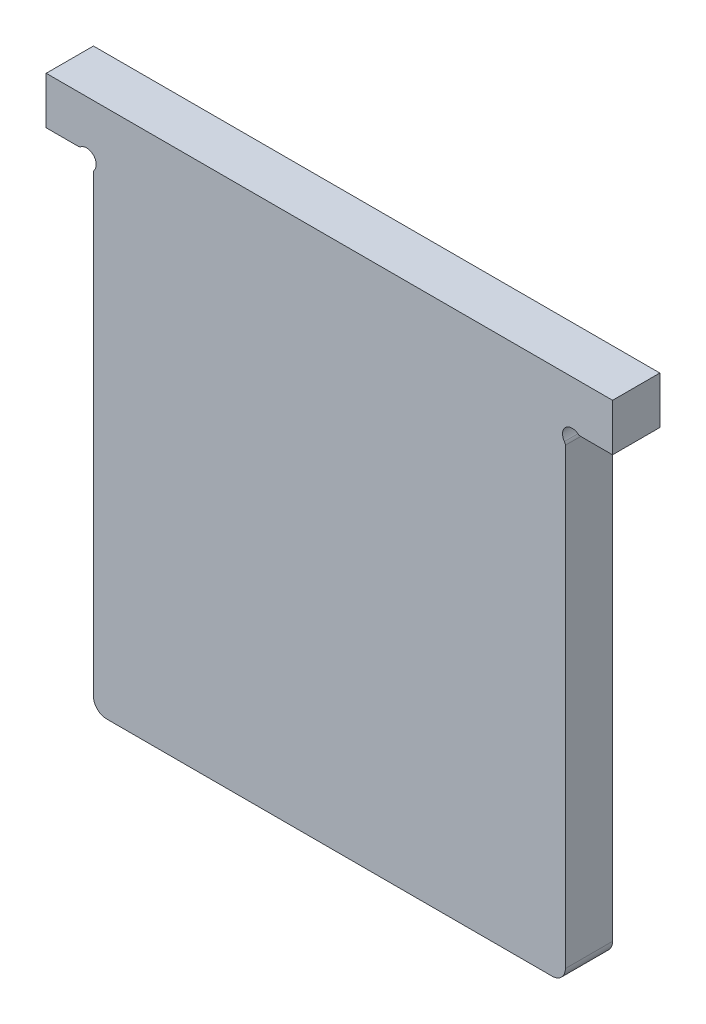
ISO-10303-21;
HEADER;
FILE_DESCRIPTION(('STEP AP214'),'2;1');
FILE_NAME('part.step','',(''),(''),'','','');
FILE_SCHEMA(('AUTOMOTIVE_DESIGN { 1 0 10303 214 1 1 1 1 }'));
ENDSEC;
DATA;
#1=APPLICATION_CONTEXT('core data for automotive mechanical design processes');
#2=APPLICATION_PROTOCOL_DEFINITION('international standard','automotive_design',2000,#1);
#3=PRODUCT_CONTEXT('',#1,'mechanical');
#4=PRODUCT('Part','Part','',(#3));
#5=PRODUCT_RELATED_PRODUCT_CATEGORY('part','',(#4));
#6=PRODUCT_DEFINITION_FORMATION('','',#4);
#7=PRODUCT_DEFINITION_CONTEXT('part definition',#1,'design');
#8=PRODUCT_DEFINITION('design','',#6,#7);
#9=PRODUCT_DEFINITION_SHAPE('','',#8);
#10=(LENGTH_UNIT() NAMED_UNIT(*) SI_UNIT(.MILLI.,.METRE.));
#11=(NAMED_UNIT(*) PLANE_ANGLE_UNIT() SI_UNIT($,.RADIAN.));
#12=(NAMED_UNIT(*) SI_UNIT($,.STERADIAN.) SOLID_ANGLE_UNIT());
#13=UNCERTAINTY_MEASURE_WITH_UNIT(LENGTH_MEASURE(1.E-05),#10,'distance_accuracy_value','');
#14=(GEOMETRIC_REPRESENTATION_CONTEXT(3) GLOBAL_UNCERTAINTY_ASSIGNED_CONTEXT((#13)) GLOBAL_UNIT_ASSIGNED_CONTEXT((#10,
#11,#12)) REPRESENTATION_CONTEXT('',''));
#15=CARTESIAN_POINT('',(0.,0.,0.));
#16=DIRECTION('',(0.,0.,1.));
#17=DIRECTION('',(1.,0.,0.));
#18=AXIS2_PLACEMENT_3D('',#15,#16,#17);
#19=CARTESIAN_POINT('',(149.9,280.,25.));
#20=DIRECTION('',(1.,0.,0.));
#21=DIRECTION('',(0.,0.,-1.));
#22=AXIS2_PLACEMENT_3D('',#19,#20,#21);
#23=PLANE('',#22);
#24=DIRECTION('',(0.,-1.,0.));
#25=VECTOR('',#24,1.);
#26=CARTESIAN_POINT('',(149.9,280.,0.));
#27=LINE('',#26,#25);
#28=CARTESIAN_POINT('',(149.9,280.,0.));
#29=VERTEX_POINT('',#28);
#30=CARTESIAN_POINT('',(149.9,255.,0.));
#31=VERTEX_POINT('',#30);
#32=EDGE_CURVE('E191',#29,#31,#27,.T.);
#33=ORIENTED_EDGE('',*,*,#32,.F.);
#34=DIRECTION('',(0.,0.,-1.));
#35=VECTOR('',#34,1.);
#36=CARTESIAN_POINT('',(149.9,280.,25.));
#37=LINE('',#36,#35);
#38=CARTESIAN_POINT('',(149.9,280.,25.));
#39=VERTEX_POINT('',#38);
#40=EDGE_CURVE('E234',#39,#29,#37,.T.);
#41=ORIENTED_EDGE('',*,*,#40,.F.);
#42=DIRECTION('',(0.,-1.,0.));
#43=VECTOR('',#42,1.);
#44=CARTESIAN_POINT('',(149.9,280.,25.));
#45=LINE('',#44,#43);
#46=CARTESIAN_POINT('',(149.9,255.,25.));
#47=VERTEX_POINT('',#46);
#48=EDGE_CURVE('E192',#39,#47,#45,.T.);
#49=ORIENTED_EDGE('',*,*,#48,.T.);
#50=DIRECTION('',(0.,0.,-1.));
#51=VECTOR('',#50,1.);
#52=CARTESIAN_POINT('',(149.9,255.,25.));
#53=LINE('',#52,#51);
#54=EDGE_CURVE('E213',#47,#31,#53,.T.);
#55=ORIENTED_EDGE('',*,*,#54,.T.);
#56=EDGE_LOOP('',(#33,#41,#49,#55));
#57=FACE_BOUND('',#56,.T.);
#58=ADVANCED_FACE('F33',(#57),#23,.T.);
#59=CARTESIAN_POINT('',(0.,280.,25.));
#60=DIRECTION('',(0.,1.,0.));
#61=DIRECTION('',(0.,0.,1.));
#62=AXIS2_PLACEMENT_3D('',#59,#60,#61);
#63=PLANE('',#62);
#64=DIRECTION('',(1.,0.,0.));
#65=VECTOR('',#64,1.);
#66=CARTESIAN_POINT('',(0.,280.,0.));
#67=LINE('',#66,#65);
#68=CARTESIAN_POINT('',(-149.9,280.,0.));
#69=VERTEX_POINT('',#68);
#70=EDGE_CURVE('E196',#69,#29,#67,.T.);
#71=ORIENTED_EDGE('',*,*,#70,.F.);
#72=DIRECTION('',(0.,0.,-1.));
#73=VECTOR('',#72,1.);
#74=CARTESIAN_POINT('',(-149.9,280.,25.));
#75=LINE('',#74,#73);
#76=CARTESIAN_POINT('',(-149.9,280.,25.));
#77=VERTEX_POINT('',#76);
#78=EDGE_CURVE('E183',#77,#69,#75,.T.);
#79=ORIENTED_EDGE('',*,*,#78,.F.);
#80=DIRECTION('',(1.,0.,0.));
#81=VECTOR('',#80,1.);
#82=CARTESIAN_POINT('',(0.,280.,25.));
#83=LINE('',#82,#81);
#84=EDGE_CURVE('E161',#77,#39,#83,.T.);
#85=ORIENTED_EDGE('',*,*,#84,.T.);
#86=ORIENTED_EDGE('',*,*,#40,.T.);
#87=EDGE_LOOP('',(#71,#79,#85,#86));
#88=FACE_BOUND('',#87,.T.);
#89=ADVANCED_FACE('F273',(#88),#63,.T.);
#90=CARTESIAN_POINT('',(0.,0.,25.));
#91=DIRECTION('',(0.,1.,0.));
#92=DIRECTION('',(0.,0.,1.));
#93=AXIS2_PLACEMENT_3D('',#90,#91,#92);
#94=PLANE('',#93);
#95=DIRECTION('',(1.,0.,0.));
#96=VECTOR('',#95,1.);
#97=CARTESIAN_POINT('',(0.,0.,0.));
#98=LINE('',#97,#96);
#99=CARTESIAN_POINT('',(-117.9,0.,0.));
#100=VERTEX_POINT('',#99);
#101=CARTESIAN_POINT('',(117.9,0.,0.));
#102=VERTEX_POINT('',#101);
#103=EDGE_CURVE('E230',#100,#102,#98,.T.);
#104=ORIENTED_EDGE('',*,*,#103,.T.);
#105=DIRECTION('',(0.,0.,-1.));
#106=VECTOR('',#105,1.);
#107=CARTESIAN_POINT('',(117.9,0.,25.));
#108=LINE('',#107,#106);
#109=CARTESIAN_POINT('',(117.9,0.,25.));
#110=VERTEX_POINT('',#109);
#111=EDGE_CURVE('E41',#102,#110,#108,.F.);
#112=ORIENTED_EDGE('',*,*,#111,.T.);
#113=DIRECTION('',(1.,0.,0.));
#114=VECTOR('',#113,1.);
#115=CARTESIAN_POINT('',(0.,0.,25.));
#116=LINE('',#115,#114);
#117=CARTESIAN_POINT('',(-117.9,0.,25.));
#118=VERTEX_POINT('',#117);
#119=EDGE_CURVE('E210',#118,#110,#116,.T.);
#120=ORIENTED_EDGE('',*,*,#119,.F.);
#121=DIRECTION('',(0.,0.,-1.));
#122=VECTOR('',#121,1.);
#123=CARTESIAN_POINT('',(-117.9,0.,25.));
#124=LINE('',#123,#122);
#125=EDGE_CURVE('E186',#100,#118,#124,.F.);
#126=ORIENTED_EDGE('',*,*,#125,.F.);
#127=EDGE_LOOP('',(#104,#112,#120,#126));
#128=FACE_BOUND('',#127,.T.);
#129=ADVANCED_FACE('F278',(#128),#94,.F.);
#130=CARTESIAN_POINT('',(124.9,246.868959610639,25.));
#131=DIRECTION('',(1.,0.,0.));
#132=DIRECTION('',(0.,1.,0.));
#133=AXIS2_PLACEMENT_3D('',#130,#131,#132);
#134=PLANE('',#133);
#135=DIRECTION('',(0.,-1.,0.));
#136=VECTOR('',#135,1.);
#137=CARTESIAN_POINT('',(124.9,246.868959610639,25.));
#138=LINE('',#137,#136);
#139=CARTESIAN_POINT('',(124.9,246.868959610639,25.));
#140=VERTEX_POINT('',#139);
#141=CARTESIAN_POINT('',(124.9,7.00000000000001,25.));
#142=VERTEX_POINT('',#141);
#143=EDGE_CURVE('E207',#140,#142,#138,.T.);
#144=ORIENTED_EDGE('',*,*,#143,.T.);
#145=DIRECTION('',(0.,0.,-1.));
#146=VECTOR('',#145,1.);
#147=CARTESIAN_POINT('',(124.9,7.00000000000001,0.));
#148=LINE('',#147,#146);
#149=CARTESIAN_POINT('',(124.9,7.00000000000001,0.));
#150=VERTEX_POINT('',#149);
#151=EDGE_CURVE('E236',#142,#150,#148,.T.);
#152=ORIENTED_EDGE('',*,*,#151,.T.);
#153=DIRECTION('',(0.,-1.,0.));
#154=VECTOR('',#153,1.);
#155=CARTESIAN_POINT('',(124.9,246.868959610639,0.));
#156=LINE('',#155,#154);
#157=CARTESIAN_POINT('',(124.9,246.868959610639,0.));
#158=VERTEX_POINT('',#157);
#159=EDGE_CURVE('E228',#158,#150,#156,.T.);
#160=ORIENTED_EDGE('',*,*,#159,.F.);
#161=DIRECTION('',(0.,0.,-1.));
#162=VECTOR('',#161,1.);
#163=CARTESIAN_POINT('',(124.9,246.868959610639,25.));
#164=LINE('',#163,#162);
#165=EDGE_CURVE('E237',#140,#158,#164,.T.);
#166=ORIENTED_EDGE('',*,*,#165,.F.);
#167=EDGE_LOOP('',(#144,#152,#160,#166));
#168=FACE_BOUND('',#167,.T.);
#169=ADVANCED_FACE('F251',(#168),#134,.T.);
#170=CARTESIAN_POINT('',(122.4,246.868959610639,25.));
#171=DIRECTION('',(0.,0.,-1.));
#172=DIRECTION('',(-1.,0.,0.));
#173=AXIS2_PLACEMENT_3D('',#170,#171,#172);
#174=CYLINDRICAL_SURFACE('',#173,2.5);
#175=CARTESIAN_POINT('',(122.4,246.868959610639,0.));
#176=DIRECTION('',(0.,0.,-1.));
#177=DIRECTION('',(-1.,0.,0.));
#178=AXIS2_PLACEMENT_3D('',#175,#176,#177);
#179=CIRCLE('',#178,2.5);
#180=CARTESIAN_POINT('',(124.408633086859,248.357379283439,0.));
#181=VERTEX_POINT('',#180);
#182=EDGE_CURVE('E225',#181,#158,#179,.T.);
#183=ORIENTED_EDGE('',*,*,#182,.F.);
#184=DIRECTION('',(0.,0.,-1.));
#185=VECTOR('',#184,1.);
#186=CARTESIAN_POINT('',(124.408633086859,248.357379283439,25.));
#187=LINE('',#186,#185);
#188=CARTESIAN_POINT('',(124.408633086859,248.357379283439,25.));
#189=VERTEX_POINT('',#188);
#190=EDGE_CURVE('E239',#189,#181,#187,.T.);
#191=ORIENTED_EDGE('',*,*,#190,.F.);
#192=CARTESIAN_POINT('',(122.4,246.868959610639,25.));
#193=DIRECTION('',(0.,0.,-1.));
#194=DIRECTION('',(-1.,0.,0.));
#195=AXIS2_PLACEMENT_3D('',#192,#193,#194);
#196=CIRCLE('',#195,2.5);
#197=EDGE_CURVE('E204',#189,#140,#196,.T.);
#198=ORIENTED_EDGE('',*,*,#197,.T.);
#199=ORIENTED_EDGE('',*,*,#165,.T.);
#200=EDGE_LOOP('',(#183,#191,#198,#199));
#201=FACE_BOUND('',#200,.T.);
#202=ADVANCED_FACE('F260',(#201),#174,.T.);
#203=CARTESIAN_POINT('',(128.506244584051,251.393755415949,25.));
#204=DIRECTION('',(0.,0.,-1.));
#205=DIRECTION('',(-1.,0.,0.));
#206=AXIS2_PLACEMENT_3D('',#203,#204,#205);
#207=CYLINDRICAL_SURFACE('',#206,5.09999999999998);
#208=CARTESIAN_POINT('',(128.506244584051,251.393755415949,0.));
#209=DIRECTION('',(0.,0.,1.));
#210=DIRECTION('',(1.,0.,0.));
#211=AXIS2_PLACEMENT_3D('',#208,#209,#210);
#212=CIRCLE('',#211,5.09999999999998);
#213=CARTESIAN_POINT('',(131.542620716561,255.491366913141,0.));
#214=VERTEX_POINT('',#213);
#215=EDGE_CURVE('E222',#214,#181,#212,.T.);
#216=ORIENTED_EDGE('',*,*,#215,.F.);
#217=DIRECTION('',(0.,0.,-1.));
#218=VECTOR('',#217,1.);
#219=CARTESIAN_POINT('',(131.542620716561,255.491366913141,25.));
#220=LINE('',#219,#218);
#221=CARTESIAN_POINT('',(131.542620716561,255.491366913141,25.));
#222=VERTEX_POINT('',#221);
#223=EDGE_CURVE('E241',#222,#214,#220,.T.);
#224=ORIENTED_EDGE('',*,*,#223,.F.);
#225=CARTESIAN_POINT('',(128.506244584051,251.393755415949,25.));
#226=DIRECTION('',(0.,0.,1.));
#227=DIRECTION('',(1.,0.,0.));
#228=AXIS2_PLACEMENT_3D('',#225,#226,#227);
#229=CIRCLE('',#228,5.09999999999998);
#230=EDGE_CURVE('E201',#222,#189,#229,.T.);
#231=ORIENTED_EDGE('',*,*,#230,.T.);
#232=ORIENTED_EDGE('',*,*,#190,.T.);
#233=EDGE_LOOP('',(#216,#224,#231,#232));
#234=FACE_BOUND('',#233,.T.);
#235=ADVANCED_FACE('F290',(#234),#207,.F.);
#236=CARTESIAN_POINT('',(133.03104038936,257.5,25.));
#237=DIRECTION('',(0.,0.,-1.));
#238=DIRECTION('',(-1.,0.,0.));
#239=AXIS2_PLACEMENT_3D('',#236,#237,#238);
#240=CYLINDRICAL_SURFACE('',#239,2.49999999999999);
#241=CARTESIAN_POINT('',(133.03104038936,257.5,0.));
#242=DIRECTION('',(0.,0.,1.));
#243=DIRECTION('',(1.,0.,0.));
#244=AXIS2_PLACEMENT_3D('',#241,#242,#243);
#245=CIRCLE('',#244,2.49999999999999);
#246=CARTESIAN_POINT('',(133.03104038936,255.,0.));
#247=VERTEX_POINT('',#246);
#248=EDGE_CURVE('E219',#214,#247,#245,.T.);
#249=ORIENTED_EDGE('',*,*,#248,.T.);
#250=DIRECTION('',(0.,0.,-1.));
#251=VECTOR('',#250,1.);
#252=CARTESIAN_POINT('',(133.03104038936,255.,25.));
#253=LINE('',#252,#251);
#254=CARTESIAN_POINT('',(133.03104038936,255.,25.));
#255=VERTEX_POINT('',#254);
#256=EDGE_CURVE('E243',#255,#247,#253,.T.);
#257=ORIENTED_EDGE('',*,*,#256,.F.);
#258=CARTESIAN_POINT('',(133.03104038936,257.5,25.));
#259=DIRECTION('',(0.,0.,1.));
#260=DIRECTION('',(1.,0.,0.));
#261=AXIS2_PLACEMENT_3D('',#258,#259,#260);
#262=CIRCLE('',#261,2.49999999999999);
#263=EDGE_CURVE('E199',#222,#255,#262,.T.);
#264=ORIENTED_EDGE('',*,*,#263,.F.);
#265=ORIENTED_EDGE('',*,*,#223,.T.);
#266=EDGE_LOOP('',(#249,#257,#264,#265));
#267=FACE_BOUND('',#266,.T.);
#268=ADVANCED_FACE('F286',(#267),#240,.T.);
#269=CARTESIAN_POINT('',(149.9,255.,25.));
#270=DIRECTION('',(0.,-1.,0.));
#271=DIRECTION('',(1.,0.,0.));
#272=AXIS2_PLACEMENT_3D('',#269,#270,#271);
#273=PLANE('',#272);
#274=DIRECTION('',(-1.,0.,0.));
#275=VECTOR('',#274,1.);
#276=CARTESIAN_POINT('',(149.9,255.,0.));
#277=LINE('',#276,#275);
#278=EDGE_CURVE('E216',#31,#247,#277,.T.);
#279=ORIENTED_EDGE('',*,*,#278,.F.);
#280=ORIENTED_EDGE('',*,*,#54,.F.);
#281=DIRECTION('',(-1.,0.,0.));
#282=VECTOR('',#281,1.);
#283=CARTESIAN_POINT('',(149.9,255.,25.));
#284=LINE('',#283,#282);
#285=EDGE_CURVE('E195',#47,#255,#284,.T.);
#286=ORIENTED_EDGE('',*,*,#285,.T.);
#287=ORIENTED_EDGE('',*,*,#256,.T.);
#288=EDGE_LOOP('',(#279,#280,#286,#287));
#289=FACE_BOUND('',#288,.T.);
#290=ADVANCED_FACE('F283',(#289),#273,.T.);
#291=CARTESIAN_POINT('',(133.03104038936,257.5,25.));
#292=DIRECTION('',(0.,0.,1.));
#293=DIRECTION('',(1.,0.,0.));
#294=AXIS2_PLACEMENT_3D('',#291,#292,#293);
#295=PLANE('',#294);
#296=ORIENTED_EDGE('',*,*,#119,.T.);
#297=CARTESIAN_POINT('',(117.9,7.00000000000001,25.));
#298=DIRECTION('',(0.,0.,1.));
#299=DIRECTION('',(1.,0.,0.));
#300=AXIS2_PLACEMENT_3D('',#297,#298,#299);
#301=CIRCLE('',#300,7.);
#302=EDGE_CURVE('E11',#110,#142,#301,.T.);
#303=ORIENTED_EDGE('',*,*,#302,.T.);
#304=ORIENTED_EDGE('',*,*,#143,.F.);
#305=ORIENTED_EDGE('',*,*,#197,.F.);
#306=ORIENTED_EDGE('',*,*,#230,.F.);
#307=ORIENTED_EDGE('',*,*,#263,.T.);
#308=ORIENTED_EDGE('',*,*,#285,.F.);
#309=ORIENTED_EDGE('',*,*,#48,.F.);
#310=ORIENTED_EDGE('',*,*,#84,.F.);
#311=DIRECTION('',(0.,-1.,0.));
#312=VECTOR('',#311,1.);
#313=CARTESIAN_POINT('',(-149.9,280.,25.));
#314=LINE('',#313,#312);
#315=CARTESIAN_POINT('',(-149.9,255.,25.));
#316=VERTEX_POINT('',#315);
#317=EDGE_CURVE('E155',#77,#316,#314,.T.);
#318=ORIENTED_EDGE('',*,*,#317,.T.);
#319=DIRECTION('',(1.,0.,0.));
#320=VECTOR('',#319,1.);
#321=CARTESIAN_POINT('',(-149.9,255.,25.));
#322=LINE('',#321,#320);
#323=CARTESIAN_POINT('',(-133.03104038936,255.,25.));
#324=VERTEX_POINT('',#323);
#325=EDGE_CURVE('E144',#316,#324,#322,.T.);
#326=ORIENTED_EDGE('',*,*,#325,.T.);
#327=CARTESIAN_POINT('',(-133.03104038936,257.5,25.));
#328=DIRECTION('',(0.,0.,-1.));
#329=DIRECTION('',(-1.,0.,0.));
#330=AXIS2_PLACEMENT_3D('',#327,#328,#329);
#331=CIRCLE('',#330,2.49999999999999);
#332=CARTESIAN_POINT('',(-131.542620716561,255.491366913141,25.));
#333=VERTEX_POINT('',#332);
#334=EDGE_CURVE('E154',#333,#324,#331,.T.);
#335=ORIENTED_EDGE('',*,*,#334,.F.);
#336=CARTESIAN_POINT('',(-128.506244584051,251.393755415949,25.));
#337=DIRECTION('',(0.,0.,-1.));
#338=DIRECTION('',(-1.,0.,0.));
#339=AXIS2_PLACEMENT_3D('',#336,#337,#338);
#340=CIRCLE('',#339,5.09999999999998);
#341=CARTESIAN_POINT('',(-124.408633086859,248.357379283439,25.));
#342=VERTEX_POINT('',#341);
#343=EDGE_CURVE('E333',#333,#342,#340,.T.);
#344=ORIENTED_EDGE('',*,*,#343,.T.);
#345=CARTESIAN_POINT('',(-122.4,246.868959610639,25.));
#346=DIRECTION('',(0.,0.,1.));
#347=DIRECTION('',(1.,0.,0.));
#348=AXIS2_PLACEMENT_3D('',#345,#346,#347);
#349=CIRCLE('',#348,2.5);
#350=CARTESIAN_POINT('',(-124.9,246.868959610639,25.));
#351=VERTEX_POINT('',#350);
#352=EDGE_CURVE('E175',#342,#351,#349,.T.);
#353=ORIENTED_EDGE('',*,*,#352,.T.);
#354=DIRECTION('',(0.,-1.,0.));
#355=VECTOR('',#354,1.);
#356=CARTESIAN_POINT('',(-124.9,246.868959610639,25.));
#357=LINE('',#356,#355);
#358=CARTESIAN_POINT('',(-124.9,7.00000000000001,25.));
#359=VERTEX_POINT('',#358);
#360=EDGE_CURVE('E170',#351,#359,#357,.T.);
#361=ORIENTED_EDGE('',*,*,#360,.T.);
#362=CARTESIAN_POINT('',(-117.9,7.00000000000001,25.));
#363=DIRECTION('',(0.,0.,-1.));
#364=DIRECTION('',(-1.,0.,0.));
#365=AXIS2_PLACEMENT_3D('',#362,#363,#364);
#366=CIRCLE('',#365,7.);
#367=EDGE_CURVE('E189',#118,#359,#366,.T.);
#368=ORIENTED_EDGE('',*,*,#367,.F.);
#369=EDGE_LOOP('',(#296,#303,#304,#305,#306,#307,#308,#309,#310,#318,#326,#335,#344,#353,#361,#368));
#370=FACE_BOUND('',#369,.T.);
#371=ADVANCED_FACE('F158',(#370),#295,.T.);
#372=CARTESIAN_POINT('',(133.03104038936,257.5,0.));
#373=DIRECTION('',(0.,0.,1.));
#374=DIRECTION('',(1.,0.,0.));
#375=AXIS2_PLACEMENT_3D('',#372,#373,#374);
#376=PLANE('',#375);
#377=ORIENTED_EDGE('',*,*,#159,.T.);
#378=CARTESIAN_POINT('',(117.9,7.00000000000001,0.));
#379=DIRECTION('',(0.,0.,1.));
#380=DIRECTION('',(1.,0.,0.));
#381=AXIS2_PLACEMENT_3D('',#378,#379,#380);
#382=CIRCLE('',#381,7.);
#383=EDGE_CURVE('E55',#150,#102,#382,.F.);
#384=ORIENTED_EDGE('',*,*,#383,.T.);
#385=ORIENTED_EDGE('',*,*,#103,.F.);
#386=CARTESIAN_POINT('',(-117.9,7.00000000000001,0.));
#387=DIRECTION('',(0.,0.,-1.));
#388=DIRECTION('',(-1.,0.,0.));
#389=AXIS2_PLACEMENT_3D('',#386,#387,#388);
#390=CIRCLE('',#389,7.);
#391=CARTESIAN_POINT('',(-124.9,7.00000000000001,0.));
#392=VERTEX_POINT('',#391);
#393=EDGE_CURVE('E182',#392,#100,#390,.F.);
#394=ORIENTED_EDGE('',*,*,#393,.F.);
#395=DIRECTION('',(0.,-1.,0.));
#396=VECTOR('',#395,1.);
#397=CARTESIAN_POINT('',(-124.9,246.868959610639,0.));
#398=LINE('',#397,#396);
#399=CARTESIAN_POINT('',(-124.9,246.868959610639,0.));
#400=VERTEX_POINT('',#399);
#401=EDGE_CURVE('E165',#400,#392,#398,.T.);
#402=ORIENTED_EDGE('',*,*,#401,.F.);
#403=CARTESIAN_POINT('',(-122.4,246.868959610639,0.));
#404=DIRECTION('',(0.,0.,1.));
#405=DIRECTION('',(1.,0.,0.));
#406=AXIS2_PLACEMENT_3D('',#403,#404,#405);
#407=CIRCLE('',#406,2.5);
#408=CARTESIAN_POINT('',(-124.408633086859,248.357379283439,0.));
#409=VERTEX_POINT('',#408);
#410=EDGE_CURVE('E338',#409,#400,#407,.T.);
#411=ORIENTED_EDGE('',*,*,#410,.F.);
#412=CARTESIAN_POINT('',(-128.506244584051,251.393755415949,0.));
#413=DIRECTION('',(0.,0.,-1.));
#414=DIRECTION('',(-1.,0.,0.));
#415=AXIS2_PLACEMENT_3D('',#412,#413,#414);
#416=CIRCLE('',#415,5.09999999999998);
#417=CARTESIAN_POINT('',(-131.542620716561,255.491366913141,0.));
#418=VERTEX_POINT('',#417);
#419=EDGE_CURVE('E348',#418,#409,#416,.T.);
#420=ORIENTED_EDGE('',*,*,#419,.F.);
#421=CARTESIAN_POINT('',(-133.03104038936,257.5,0.));
#422=DIRECTION('',(0.,0.,-1.));
#423=DIRECTION('',(-1.,0.,0.));
#424=AXIS2_PLACEMENT_3D('',#421,#422,#423);
#425=CIRCLE('',#424,2.49999999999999);
#426=CARTESIAN_POINT('',(-133.03104038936,255.,0.));
#427=VERTEX_POINT('',#426);
#428=EDGE_CURVE('E350',#418,#427,#425,.T.);
#429=ORIENTED_EDGE('',*,*,#428,.T.);
#430=DIRECTION('',(1.,0.,0.));
#431=VECTOR('',#430,1.);
#432=CARTESIAN_POINT('',(-149.9,255.,0.));
#433=LINE('',#432,#431);
#434=CARTESIAN_POINT('',(-149.9,255.,0.));
#435=VERTEX_POINT('',#434);
#436=EDGE_CURVE('E353',#435,#427,#433,.T.);
#437=ORIENTED_EDGE('',*,*,#436,.F.);
#438=DIRECTION('',(0.,-1.,0.));
#439=VECTOR('',#438,1.);
#440=CARTESIAN_POINT('',(-149.9,280.,0.));
#441=LINE('',#440,#439);
#442=EDGE_CURVE('E169',#69,#435,#441,.T.);
#443=ORIENTED_EDGE('',*,*,#442,.F.);
#444=ORIENTED_EDGE('',*,*,#70,.T.);
#445=ORIENTED_EDGE('',*,*,#32,.T.);
#446=ORIENTED_EDGE('',*,*,#278,.T.);
#447=ORIENTED_EDGE('',*,*,#248,.F.);
#448=ORIENTED_EDGE('',*,*,#215,.T.);
#449=ORIENTED_EDGE('',*,*,#182,.T.);
#450=EDGE_LOOP('',(#377,#384,#385,#394,#402,#411,#420,#429,#437,#443,#444,#445,#446,#447,#448,#449));
#451=FACE_BOUND('',#450,.T.);
#452=ADVANCED_FACE('F255',(#451),#376,.F.);
#453=CARTESIAN_POINT('',(117.9,7.00000000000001,25.));
#454=DIRECTION('',(0.,0.,1.));
#455=DIRECTION('',(1.,0.,0.));
#456=AXIS2_PLACEMENT_3D('',#453,#454,#455);
#457=CYLINDRICAL_SURFACE('',#456,7.);
#458=ORIENTED_EDGE('',*,*,#302,.F.);
#459=ORIENTED_EDGE('',*,*,#111,.F.);
#460=ORIENTED_EDGE('',*,*,#383,.F.);
#461=ORIENTED_EDGE('',*,*,#151,.F.);
#462=EDGE_LOOP('',(#458,#459,#460,#461));
#463=FACE_BOUND('',#462,.T.);
#464=ADVANCED_FACE('F35',(#463),#457,.T.);
#465=CARTESIAN_POINT('',(-149.9,280.,25.));
#466=DIRECTION('',(-1.,0.,0.));
#467=DIRECTION('',(0.,0.,-1.));
#468=AXIS2_PLACEMENT_3D('',#465,#466,#467);
#469=PLANE('',#468);
#470=ORIENTED_EDGE('',*,*,#442,.T.);
#471=DIRECTION('',(0.,0.,-1.));
#472=VECTOR('',#471,1.);
#473=CARTESIAN_POINT('',(-149.9,255.,25.));
#474=LINE('',#473,#472);
#475=EDGE_CURVE('E148',#316,#435,#474,.T.);
#476=ORIENTED_EDGE('',*,*,#475,.F.);
#477=ORIENTED_EDGE('',*,*,#317,.F.);
#478=ORIENTED_EDGE('',*,*,#78,.T.);
#479=EDGE_LOOP('',(#470,#476,#477,#478));
#480=FACE_BOUND('',#479,.T.);
#481=ADVANCED_FACE('F167',(#480),#469,.T.);
#482=CARTESIAN_POINT('',(-124.9,246.868959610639,25.));
#483=DIRECTION('',(-1.,0.,0.));
#484=DIRECTION('',(0.,1.,0.));
#485=AXIS2_PLACEMENT_3D('',#482,#483,#484);
#486=PLANE('',#485);
#487=ORIENTED_EDGE('',*,*,#360,.F.);
#488=DIRECTION('',(0.,0.,-1.));
#489=VECTOR('',#488,1.);
#490=CARTESIAN_POINT('',(-124.9,246.868959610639,25.));
#491=LINE('',#490,#489);
#492=EDGE_CURVE('E330',#351,#400,#491,.T.);
#493=ORIENTED_EDGE('',*,*,#492,.T.);
#494=ORIENTED_EDGE('',*,*,#401,.T.);
#495=DIRECTION('',(0.,0.,-1.));
#496=VECTOR('',#495,1.);
#497=CARTESIAN_POINT('',(-124.9,7.00000000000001,0.));
#498=LINE('',#497,#496);
#499=EDGE_CURVE('E179',#359,#392,#498,.T.);
#500=ORIENTED_EDGE('',*,*,#499,.F.);
#501=EDGE_LOOP('',(#487,#493,#494,#500));
#502=FACE_BOUND('',#501,.T.);
#503=ADVANCED_FACE('F269',(#502),#486,.T.);
#504=CARTESIAN_POINT('',(-122.4,246.868959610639,25.));
#505=DIRECTION('',(0.,0.,-1.));
#506=DIRECTION('',(1.,0.,0.));
#507=AXIS2_PLACEMENT_3D('',#504,#505,#506);
#508=CYLINDRICAL_SURFACE('',#507,2.5);
#509=ORIENTED_EDGE('',*,*,#410,.T.);
#510=ORIENTED_EDGE('',*,*,#492,.F.);
#511=ORIENTED_EDGE('',*,*,#352,.F.);
#512=DIRECTION('',(0.,0.,-1.));
#513=VECTOR('',#512,1.);
#514=CARTESIAN_POINT('',(-124.408633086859,248.357379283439,25.));
#515=LINE('',#514,#513);
#516=EDGE_CURVE('E340',#342,#409,#515,.T.);
#517=ORIENTED_EDGE('',*,*,#516,.T.);
#518=EDGE_LOOP('',(#509,#510,#511,#517));
#519=FACE_BOUND('',#518,.T.);
#520=ADVANCED_FACE('F316',(#519),#508,.T.);
#521=CARTESIAN_POINT('',(-128.506244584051,251.393755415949,25.));
#522=DIRECTION('',(0.,0.,-1.));
#523=DIRECTION('',(1.,0.,0.));
#524=AXIS2_PLACEMENT_3D('',#521,#522,#523);
#525=CYLINDRICAL_SURFACE('',#524,5.09999999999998);
#526=ORIENTED_EDGE('',*,*,#419,.T.);
#527=ORIENTED_EDGE('',*,*,#516,.F.);
#528=ORIENTED_EDGE('',*,*,#343,.F.);
#529=DIRECTION('',(0.,0.,-1.));
#530=VECTOR('',#529,1.);
#531=CARTESIAN_POINT('',(-131.542620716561,255.491366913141,25.));
#532=LINE('',#531,#530);
#533=EDGE_CURVE('E172',#333,#418,#532,.T.);
#534=ORIENTED_EDGE('',*,*,#533,.T.);
#535=EDGE_LOOP('',(#526,#527,#528,#534));
#536=FACE_BOUND('',#535,.T.);
#537=ADVANCED_FACE('F312',(#536),#525,.F.);
#538=CARTESIAN_POINT('',(-133.03104038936,257.5,25.));
#539=DIRECTION('',(0.,0.,-1.));
#540=DIRECTION('',(1.,0.,0.));
#541=AXIS2_PLACEMENT_3D('',#538,#539,#540);
#542=CYLINDRICAL_SURFACE('',#541,2.49999999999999);
#543=ORIENTED_EDGE('',*,*,#428,.F.);
#544=ORIENTED_EDGE('',*,*,#533,.F.);
#545=ORIENTED_EDGE('',*,*,#334,.T.);
#546=DIRECTION('',(0.,0.,-1.));
#547=VECTOR('',#546,1.);
#548=CARTESIAN_POINT('',(-133.03104038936,255.,25.));
#549=LINE('',#548,#547);
#550=EDGE_CURVE('E151',#324,#427,#549,.T.);
#551=ORIENTED_EDGE('',*,*,#550,.T.);
#552=EDGE_LOOP('',(#543,#544,#545,#551));
#553=FACE_BOUND('',#552,.T.);
#554=ADVANCED_FACE('F309',(#553),#542,.T.);
#555=CARTESIAN_POINT('',(-149.9,255.,25.));
#556=DIRECTION('',(0.,-1.,0.));
#557=DIRECTION('',(-1.,0.,0.));
#558=AXIS2_PLACEMENT_3D('',#555,#556,#557);
#559=PLANE('',#558);
#560=ORIENTED_EDGE('',*,*,#436,.T.);
#561=ORIENTED_EDGE('',*,*,#550,.F.);
#562=ORIENTED_EDGE('',*,*,#325,.F.);
#563=ORIENTED_EDGE('',*,*,#475,.T.);
#564=EDGE_LOOP('',(#560,#561,#562,#563));
#565=FACE_BOUND('',#564,.T.);
#566=ADVANCED_FACE('F146',(#565),#559,.T.);
#567=CARTESIAN_POINT('',(-117.9,7.00000000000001,25.));
#568=DIRECTION('',(0.,0.,1.));
#569=DIRECTION('',(-1.,0.,0.));
#570=AXIS2_PLACEMENT_3D('',#567,#568,#569);
#571=CYLINDRICAL_SURFACE('',#570,7.);
#572=ORIENTED_EDGE('',*,*,#367,.T.);
#573=ORIENTED_EDGE('',*,*,#499,.T.);
#574=ORIENTED_EDGE('',*,*,#393,.T.);
#575=ORIENTED_EDGE('',*,*,#125,.T.);
#576=EDGE_LOOP('',(#572,#573,#574,#575));
#577=FACE_BOUND('',#576,.T.);
#578=ADVANCED_FACE('F303',(#577),#571,.T.);
#579=CLOSED_SHELL('',(#58,#89,#129,#169,#202,#235,#268,#290,#371,#452,#464,#481,#503,#520,#537,
#554,#566,#578));
#580=MANIFOLD_SOLID_BREP('B2',#579);
#581=ADVANCED_BREP_SHAPE_REPRESENTATION('',(#18,#580),#14);
#582=SHAPE_DEFINITION_REPRESENTATION(#9,#581);
ENDSEC;
END-ISO-10303-21;
